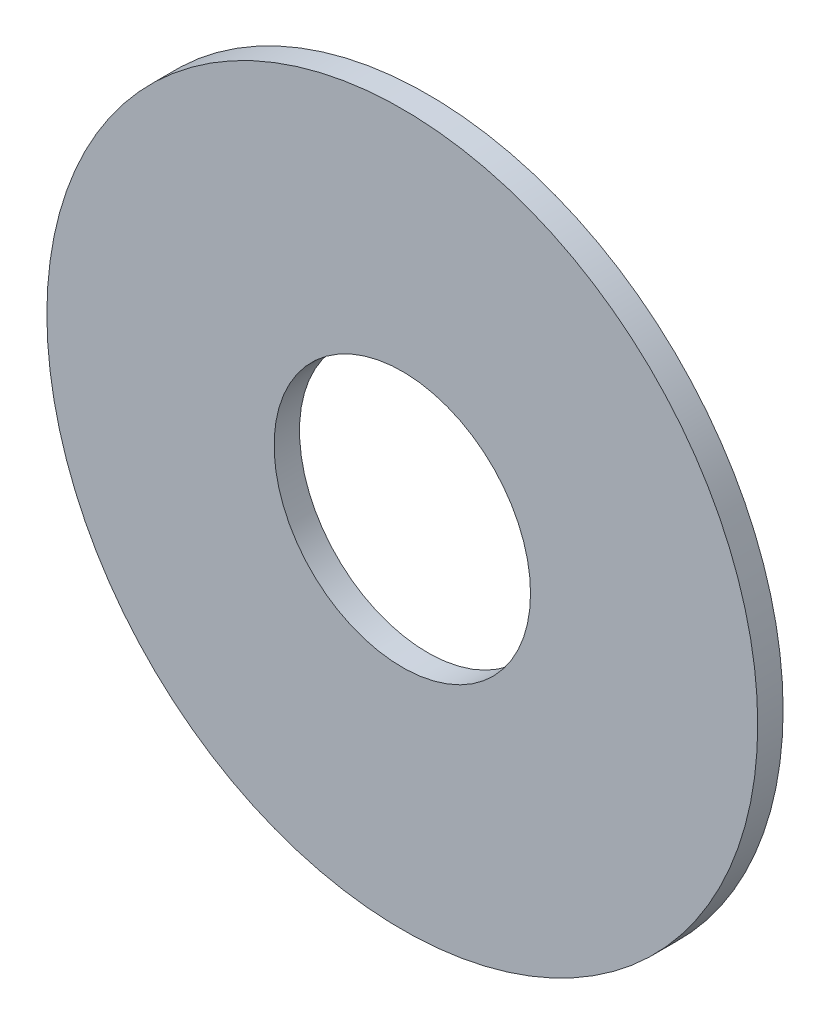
from build123d import *

# Parameters (mm, degrees)
ESQUISSE1_R      = 14
ESQUISSE1_R_2    = 5.05
EXTRUSION1_DEPTH = 1


with BuildPart() as part:
    # Esquisse1 → Extrusion1 (new body)
    with BuildSketch(Plane.XY):
        with Locations((0, 29)):
            Circle(ESQUISSE1_R)
        with Locations((0, 29)):
            Circle(ESQUISSE1_R_2, mode=Mode.SUBTRACT)
    extrude(amount=EXTRUSION1_DEPTH)


solid = part.part
